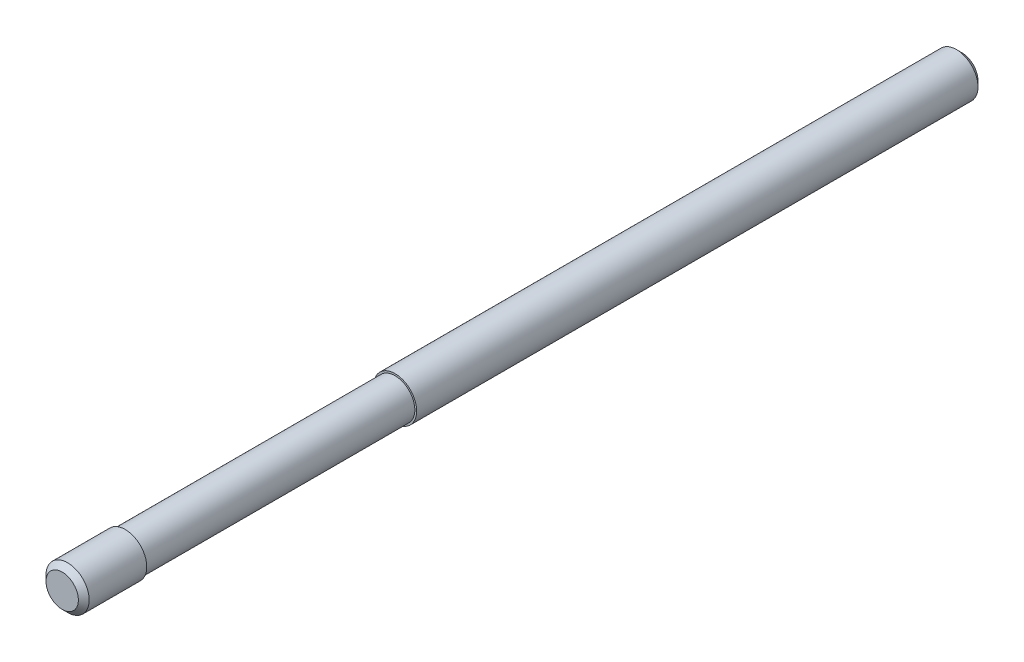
ISO-10303-21;
HEADER;
FILE_DESCRIPTION(('STEP AP214'),'2;1');
FILE_NAME('part.step','',(''),(''),'','','');
FILE_SCHEMA(('AUTOMOTIVE_DESIGN { 1 0 10303 214 1 1 1 1 }'));
ENDSEC;
DATA;
#1=APPLICATION_CONTEXT('core data for automotive mechanical design processes');
#2=APPLICATION_PROTOCOL_DEFINITION('international standard','automotive_design',2000,#1);
#3=PRODUCT_CONTEXT('',#1,'mechanical');
#4=PRODUCT('Part','Part','',(#3));
#5=PRODUCT_RELATED_PRODUCT_CATEGORY('part','',(#4));
#6=PRODUCT_DEFINITION_FORMATION('','',#4);
#7=PRODUCT_DEFINITION_CONTEXT('part definition',#1,'design');
#8=PRODUCT_DEFINITION('design','',#6,#7);
#9=PRODUCT_DEFINITION_SHAPE('','',#8);
#10=(LENGTH_UNIT() NAMED_UNIT(*) SI_UNIT(.MILLI.,.METRE.));
#11=(NAMED_UNIT(*) PLANE_ANGLE_UNIT() SI_UNIT($,.RADIAN.));
#12=(NAMED_UNIT(*) SI_UNIT($,.STERADIAN.) SOLID_ANGLE_UNIT());
#13=UNCERTAINTY_MEASURE_WITH_UNIT(LENGTH_MEASURE(1.E-05),#10,'distance_accuracy_value','');
#14=(GEOMETRIC_REPRESENTATION_CONTEXT(3) GLOBAL_UNCERTAINTY_ASSIGNED_CONTEXT((#13)) GLOBAL_UNIT_ASSIGNED_CONTEXT((#10,
#11,#12)) REPRESENTATION_CONTEXT('',''));
#15=CARTESIAN_POINT('',(0.,0.,0.));
#16=DIRECTION('',(0.,0.,1.));
#17=DIRECTION('',(1.,0.,0.));
#18=AXIS2_PLACEMENT_3D('',#15,#16,#17);
#19=CARTESIAN_POINT('',(-9.,0.,0.));
#20=DIRECTION('',(0.,0.,-1.));
#21=DIRECTION('',(-1.,0.,0.));
#22=AXIS2_PLACEMENT_3D('',#19,#20,#21);
#23=PLANE('',#22);
#24=CARTESIAN_POINT('',(0.,0.,0.));
#25=DIRECTION('',(0.,0.,-1.));
#26=DIRECTION('',(-1.,0.,0.));
#27=AXIS2_PLACEMENT_3D('',#24,#25,#26);
#28=CIRCLE('',#27,9.);
#29=CARTESIAN_POINT('',(-9.,0.,0.));
#30=VERTEX_POINT('',#29);
#31=EDGE_CURVE('E8',#30,#30,#28,.T.);
#32=ORIENTED_EDGE('',*,*,#31,.T.);
#33=EDGE_LOOP('',(#32));
#34=FACE_BOUND('',#33,.T.);
#35=ADVANCED_FACE('F12',(#34),#23,.T.);
#36=CARTESIAN_POINT('',(0.,0.,0.));
#37=DIRECTION('',(0.,0.,1.));
#38=DIRECTION('',(1.,0.,0.));
#39=AXIS2_PLACEMENT_3D('',#36,#37,#38);
#40=CONICAL_SURFACE('',#39,9.,0.785398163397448);
#41=CARTESIAN_POINT('',(0.,0.,3.));
#42=DIRECTION('',(0.,0.,-1.));
#43=DIRECTION('',(-1.,0.,0.));
#44=AXIS2_PLACEMENT_3D('',#41,#42,#43);
#45=CIRCLE('',#44,12.);
#46=CARTESIAN_POINT('',(-12.,0.,3.));
#47=VERTEX_POINT('',#46);
#48=EDGE_CURVE('E18',#47,#47,#45,.T.);
#49=ORIENTED_EDGE('',*,*,#48,.T.);
#50=EDGE_LOOP('',(#49));
#51=FACE_BOUND('',#50,.T.);
#52=ORIENTED_EDGE('',*,*,#31,.F.);
#53=EDGE_LOOP('',(#52));
#54=FACE_BOUND('',#53,.T.);
#55=ADVANCED_FACE('F57',(#51,#54),#40,.T.);
#56=CARTESIAN_POINT('',(0.,0.,0.));
#57=DIRECTION('',(0.,0.,-1.));
#58=DIRECTION('',(-1.,0.,0.));
#59=AXIS2_PLACEMENT_3D('',#56,#57,#58);
#60=CYLINDRICAL_SURFACE('',#59,12.);
#61=CARTESIAN_POINT('',(0.,0.,315.));
#62=DIRECTION('',(0.,0.,-1.));
#63=DIRECTION('',(-1.,0.,0.));
#64=AXIS2_PLACEMENT_3D('',#61,#62,#63);
#65=CIRCLE('',#64,12.);
#66=CARTESIAN_POINT('',(-12.,0.,315.));
#67=VERTEX_POINT('',#66);
#68=EDGE_CURVE('E22',#67,#67,#65,.T.);
#69=ORIENTED_EDGE('',*,*,#68,.T.);
#70=EDGE_LOOP('',(#69));
#71=FACE_BOUND('',#70,.T.);
#72=ORIENTED_EDGE('',*,*,#48,.F.);
#73=EDGE_LOOP('',(#72));
#74=FACE_BOUND('',#73,.T.);
#75=ADVANCED_FACE('F61',(#71,#74),#60,.T.);
#76=CARTESIAN_POINT('',(-11.,0.,315.));
#77=DIRECTION('',(0.,0.,1.));
#78=DIRECTION('',(1.,0.,0.));
#79=AXIS2_PLACEMENT_3D('',#76,#77,#78);
#80=PLANE('',#79);
#81=CARTESIAN_POINT('',(0.,0.,315.));
#82=DIRECTION('',(0.,0.,-1.));
#83=DIRECTION('',(-1.,0.,0.));
#84=AXIS2_PLACEMENT_3D('',#81,#82,#83);
#85=CIRCLE('',#84,11.);
#86=CARTESIAN_POINT('',(-11.,0.,315.));
#87=VERTEX_POINT('',#86);
#88=EDGE_CURVE('E26',#87,#87,#85,.T.);
#89=ORIENTED_EDGE('',*,*,#88,.T.);
#90=EDGE_LOOP('',(#89));
#91=FACE_BOUND('',#90,.T.);
#92=ORIENTED_EDGE('',*,*,#68,.F.);
#93=EDGE_LOOP('',(#92));
#94=FACE_BOUND('',#93,.T.);
#95=ADVANCED_FACE('F65',(#91,#94),#80,.T.);
#96=CARTESIAN_POINT('',(0.,0.,0.));
#97=DIRECTION('',(0.,0.,-1.));
#98=DIRECTION('',(-1.,0.,0.));
#99=AXIS2_PLACEMENT_3D('',#96,#97,#98);
#100=CYLINDRICAL_SURFACE('',#99,11.);
#101=CARTESIAN_POINT('',(0.,0.,465.));
#102=DIRECTION('',(0.,0.,-1.));
#103=DIRECTION('',(-1.,0.,0.));
#104=AXIS2_PLACEMENT_3D('',#101,#102,#103);
#105=CIRCLE('',#104,11.);
#106=CARTESIAN_POINT('',(-11.,0.,465.));
#107=VERTEX_POINT('',#106);
#108=EDGE_CURVE('E31',#107,#107,#105,.T.);
#109=ORIENTED_EDGE('',*,*,#108,.T.);
#110=EDGE_LOOP('',(#109));
#111=FACE_BOUND('',#110,.T.);
#112=ORIENTED_EDGE('',*,*,#88,.F.);
#113=EDGE_LOOP('',(#112));
#114=FACE_BOUND('',#113,.T.);
#115=ADVANCED_FACE('F72',(#111,#114),#100,.T.);
#116=CARTESIAN_POINT('',(-12.,0.,465.));
#117=DIRECTION('',(0.,0.,-1.));
#118=DIRECTION('',(-1.,0.,0.));
#119=AXIS2_PLACEMENT_3D('',#116,#117,#118);
#120=PLANE('',#119);
#121=CARTESIAN_POINT('',(0.,0.,465.));
#122=DIRECTION('',(0.,0.,-1.));
#123=DIRECTION('',(-1.,0.,0.));
#124=AXIS2_PLACEMENT_3D('',#121,#122,#123);
#125=CIRCLE('',#124,12.);
#126=CARTESIAN_POINT('',(-12.,0.,465.));
#127=VERTEX_POINT('',#126);
#128=EDGE_CURVE('E34',#127,#127,#125,.T.);
#129=ORIENTED_EDGE('',*,*,#128,.T.);
#130=EDGE_LOOP('',(#129));
#131=FACE_BOUND('',#130,.T.);
#132=ORIENTED_EDGE('',*,*,#108,.F.);
#133=EDGE_LOOP('',(#132));
#134=FACE_BOUND('',#133,.T.);
#135=ADVANCED_FACE('F76',(#131,#134),#120,.T.);
#136=CARTESIAN_POINT('',(0.,0.,0.));
#137=DIRECTION('',(0.,0.,-1.));
#138=DIRECTION('',(-1.,0.,0.));
#139=AXIS2_PLACEMENT_3D('',#136,#137,#138);
#140=CYLINDRICAL_SURFACE('',#139,12.);
#141=CARTESIAN_POINT('',(0.,0.,497.));
#142=DIRECTION('',(0.,0.,-1.));
#143=DIRECTION('',(-1.,0.,0.));
#144=AXIS2_PLACEMENT_3D('',#141,#142,#143);
#145=CIRCLE('',#144,12.);
#146=CARTESIAN_POINT('',(-12.,0.,497.));
#147=VERTEX_POINT('',#146);
#148=EDGE_CURVE('E37',#147,#147,#145,.T.);
#149=ORIENTED_EDGE('',*,*,#148,.T.);
#150=EDGE_LOOP('',(#149));
#151=FACE_BOUND('',#150,.T.);
#152=ORIENTED_EDGE('',*,*,#128,.F.);
#153=EDGE_LOOP('',(#152));
#154=FACE_BOUND('',#153,.T.);
#155=ADVANCED_FACE('F54',(#151,#154),#140,.T.);
#156=CARTESIAN_POINT('',(0.,0.,497.));
#157=DIRECTION('',(0.,0.,-1.));
#158=DIRECTION('',(-1.,0.,0.));
#159=AXIS2_PLACEMENT_3D('',#156,#157,#158);
#160=CONICAL_SURFACE('',#159,12.,0.785398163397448);
#161=CARTESIAN_POINT('',(0.,0.,500.));
#162=DIRECTION('',(0.,0.,-1.));
#163=DIRECTION('',(-1.,0.,0.));
#164=AXIS2_PLACEMENT_3D('',#161,#162,#163);
#165=CIRCLE('',#164,9.);
#166=CARTESIAN_POINT('',(-9.,0.,500.));
#167=VERTEX_POINT('',#166);
#168=EDGE_CURVE('E40',#167,#167,#165,.T.);
#169=ORIENTED_EDGE('',*,*,#168,.T.);
#170=EDGE_LOOP('',(#169));
#171=FACE_BOUND('',#170,.T.);
#172=ORIENTED_EDGE('',*,*,#148,.F.);
#173=EDGE_LOOP('',(#172));
#174=FACE_BOUND('',#173,.T.);
#175=ADVANCED_FACE('F44',(#171,#174),#160,.T.);
#176=CARTESIAN_POINT('',(0.,0.,500.));
#177=DIRECTION('',(0.,0.,1.));
#178=DIRECTION('',(1.,0.,0.));
#179=AXIS2_PLACEMENT_3D('',#176,#177,#178);
#180=PLANE('',#179);
#181=ORIENTED_EDGE('',*,*,#168,.F.);
#182=EDGE_LOOP('',(#181));
#183=FACE_BOUND('',#182,.T.);
#184=ADVANCED_FACE('F47',(#183),#180,.T.);
#185=CLOSED_SHELL('',(#35,#55,#75,#95,#115,#135,#155,#175,#184));
#186=MANIFOLD_SOLID_BREP('B1',#185);
#187=ADVANCED_BREP_SHAPE_REPRESENTATION('',(#18,#186),#14);
#188=SHAPE_DEFINITION_REPRESENTATION(#9,#187);
ENDSEC;
END-ISO-10303-21;
